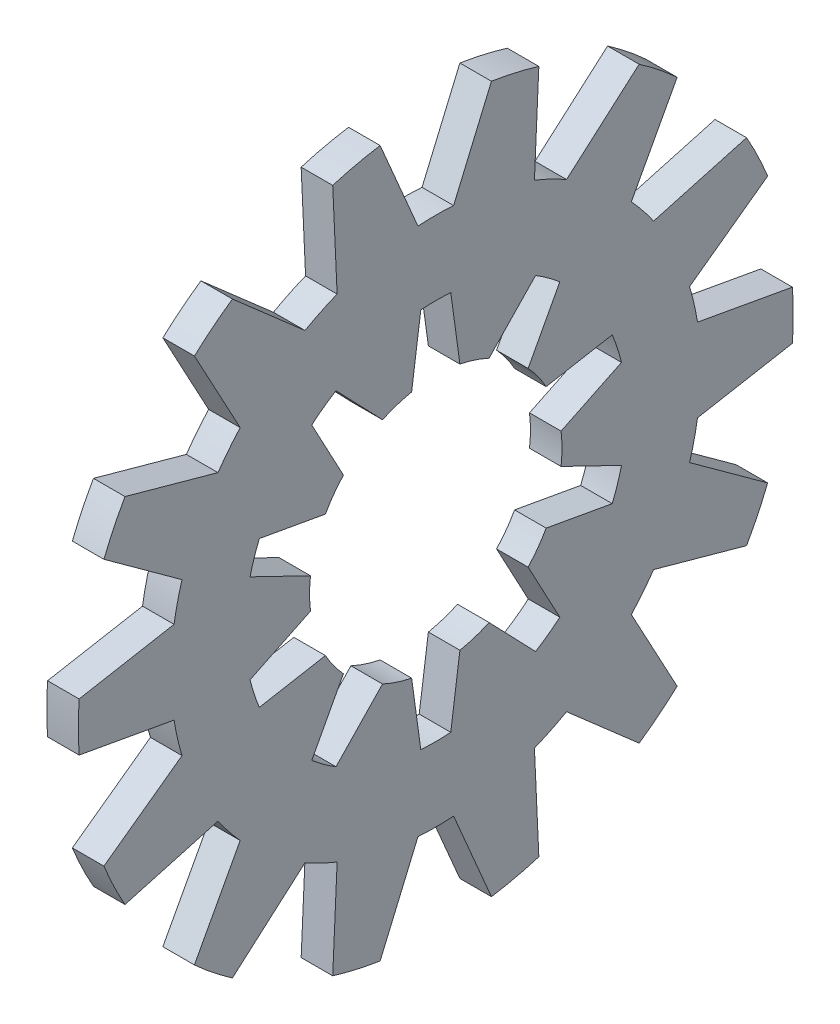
from build123d import *

# Parameters (mm, degrees)
SECSKE_W      = 0.8128
SECSKE_H      = 5.9563
EXTCUT_DEPTH  = 14.046714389
EXTCUTS_COUNT = 14
EXTCUTS_ANGLE = 334.285714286
INTCUT_DEPTH  = 13.967719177
INTCUTS_COUNT = 10
INTCUTS_ANGLE = 324


with BuildPart() as part:
    # SecSke → Body (revolve)
    with BuildSketch(Plane.XY, mode=Mode.PRIVATE) as body_sk:
        with Locations((-0.4064, 6.22935)):
            Rectangle(SECSKE_W, SECSKE_H)
    revolve(body_sk.sketch.rotate(Axis((-34.925, 0, 0), (1, 0, 0)), 90), axis=Axis((-34.925, 0, 0), (1, 0, 0)))

    # ExtCutSke → ExtCut (cut, through all)
    with BuildSketch(Plane(origin=(0, 0, 0), x_dir=(0, 0, -1), z_dir=(1, 0, 0))):
        with BuildLine():
            Line((-1.619429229, 9.531277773), (-0.459109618, 6.809520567))
            ThreePointArc((-0.459109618, 6.809520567), (0, 6.82498), (0.459109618, 6.809520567))
            Line((0.459109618, 6.809520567), (1.619429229, 9.531277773))
            ThreePointArc((1.619429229, 9.531277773), (0, 9.667875), (-1.619429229, 9.531277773))
        make_face()
    extcut = extrude(amount=-EXTCUT_DEPTH, mode=Mode.SUBTRACT)

    # ExtCuts: ExtCut ×14 about axis
    extcuts_axis = Axis((-34.925, 0, 0), (1, 0, 0))
    for i in range(1, EXTCUTS_COUNT):
        add(extcut.rotate(extcuts_axis, i * EXTCUTS_ANGLE / (EXTCUTS_COUNT - 1)), mode=Mode.SUBTRACT)

    # IntCutSke → IntCut (cut, through all)
    with BuildSketch(Plane(origin=(0, 0, 0), x_dir=(0, 0, -1), z_dir=(1, 0, 0))):
        with BuildLine():
            Line((-0.385937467, 4.903800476), (-0.645327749, 3.020471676))
            ThreePointArc((-0.645327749, 3.020471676), (0, 3.08864), (0.645327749, 3.020471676))
            Line((0.645327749, 3.020471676), (0.385937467, 4.903800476))
            ThreePointArc((0.385937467, 4.903800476), (0, 4.918964), (-0.385937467, 4.903800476))
        make_face()
    intcut = extrude(amount=-INTCUT_DEPTH, mode=Mode.SUBTRACT)

    # IntCuts: IntCut ×10 about axis
    intcuts_axis = Axis((-34.925, 0, 0), (1, 0, 0))
    for i in range(1, INTCUTS_COUNT):
        add(intcut.rotate(intcuts_axis, i * INTCUTS_ANGLE / (INTCUTS_COUNT - 1)), mode=Mode.SUBTRACT)


solid = part.part
